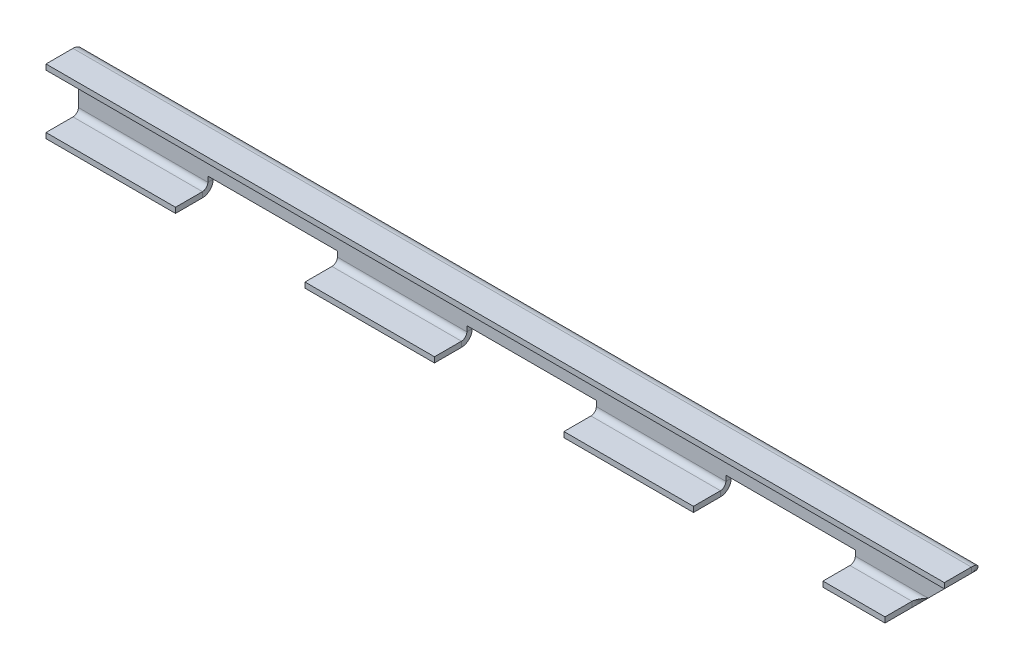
ISO-10303-21;
HEADER;
FILE_DESCRIPTION(('STEP AP214'),'2;1');
FILE_NAME('part.step','',(''),(''),'','','');
FILE_SCHEMA(('AUTOMOTIVE_DESIGN { 1 0 10303 214 1 1 1 1 }'));
ENDSEC;
DATA;
#1=APPLICATION_CONTEXT('core data for automotive mechanical design processes');
#2=APPLICATION_PROTOCOL_DEFINITION('international standard','automotive_design',2000,#1);
#3=PRODUCT_CONTEXT('',#1,'mechanical');
#4=PRODUCT('Part','Part','',(#3));
#5=PRODUCT_RELATED_PRODUCT_CATEGORY('part','',(#4));
#6=PRODUCT_DEFINITION_FORMATION('','',#4);
#7=PRODUCT_DEFINITION_CONTEXT('part definition',#1,'design');
#8=PRODUCT_DEFINITION('design','',#6,#7);
#9=PRODUCT_DEFINITION_SHAPE('','',#8);
#10=(LENGTH_UNIT() NAMED_UNIT(*) SI_UNIT(.MILLI.,.METRE.));
#11=(NAMED_UNIT(*) PLANE_ANGLE_UNIT() SI_UNIT($,.RADIAN.));
#12=(NAMED_UNIT(*) SI_UNIT($,.STERADIAN.) SOLID_ANGLE_UNIT());
#13=UNCERTAINTY_MEASURE_WITH_UNIT(LENGTH_MEASURE(1.E-05),#10,'distance_accuracy_value','');
#14=(GEOMETRIC_REPRESENTATION_CONTEXT(3) GLOBAL_UNCERTAINTY_ASSIGNED_CONTEXT((#13)) GLOBAL_UNIT_ASSIGNED_CONTEXT((#10,
#11,#12)) REPRESENTATION_CONTEXT('',''));
#15=CARTESIAN_POINT('',(0.,0.,0.));
#16=DIRECTION('',(0.,0.,1.));
#17=DIRECTION('',(1.,0.,0.));
#18=AXIS2_PLACEMENT_3D('',#15,#16,#17);
#19=CARTESIAN_POINT('',(-149.225,-76.2,38.1));
#20=DIRECTION('',(-1.,0.,0.));
#21=DIRECTION('',(0.,0.,1.));
#22=AXIS2_PLACEMENT_3D('',#19,#20,#21);
#23=PLANE('',#22);
#24=DIRECTION('',(0.,1.,0.));
#25=VECTOR('',#24,1.);
#26=CARTESIAN_POINT('',(-149.225,-76.2,-6.35));
#27=LINE('',#26,#25);
#28=CARTESIAN_POINT('',(-149.225,-63.5000000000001,-6.35));
#29=VERTEX_POINT('',#28);
#30=CARTESIAN_POINT('',(-149.225,-57.15,-6.35));
#31=VERTEX_POINT('',#30);
#32=EDGE_CURVE('E695',#29,#31,#27,.T.);
#33=ORIENTED_EDGE('',*,*,#32,.F.);
#34=DIRECTION('',(0.,0.,1.));
#35=VECTOR('',#34,1.);
#36=CARTESIAN_POINT('',(-149.225,-63.5000000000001,-6.35));
#37=LINE('',#36,#35);
#38=CARTESIAN_POINT('',(-149.225,-63.5000000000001,0.));
#39=VERTEX_POINT('',#38);
#40=EDGE_CURVE('E13',#29,#39,#37,.T.);
#41=ORIENTED_EDGE('',*,*,#40,.T.);
#42=DIRECTION('',(0.,1.,0.));
#43=VECTOR('',#42,1.);
#44=CARTESIAN_POINT('',(-149.225,0.,0.));
#45=LINE('',#44,#43);
#46=CARTESIAN_POINT('',(-149.225,-57.15,0.));
#47=VERTEX_POINT('',#46);
#48=EDGE_CURVE('E470',#39,#47,#45,.T.);
#49=ORIENTED_EDGE('',*,*,#48,.T.);
#50=DIRECTION('',(0.,0.,-1.));
#51=VECTOR('',#50,1.);
#52=CARTESIAN_POINT('',(-149.225,-57.15,38.1));
#53=LINE('',#52,#51);
#54=EDGE_CURVE('E477',#47,#31,#53,.T.);
#55=ORIENTED_EDGE('',*,*,#54,.T.);
#56=EDGE_LOOP('',(#33,#41,#49,#55));
#57=FACE_BOUND('',#56,.T.);
#58=ADVANCED_FACE('F77',(#57),#23,.T.);
#59=DIRECTION('',(0.,0.,-1.));
#60=VECTOR('',#59,1.);
#61=CARTESIAN_POINT('',(-149.225,-69.85,-2.77555756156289E-13));
#62=LINE('',#61,#60);
#63=CARTESIAN_POINT('',(-149.225,-69.8500000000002,38.1));
#64=VERTEX_POINT('',#63);
#65=CARTESIAN_POINT('',(-149.225,-69.8500000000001,6.34999999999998));
#66=VERTEX_POINT('',#65);
#67=EDGE_CURVE('E330',#64,#66,#62,.T.);
#68=ORIENTED_EDGE('',*,*,#67,.T.);
#69=DIRECTION('',(0.,-1.,0.));
#70=VECTOR('',#69,1.);
#71=CARTESIAN_POINT('',(-149.225,-69.8500000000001,6.34999999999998));
#72=LINE('',#71,#70);
#73=CARTESIAN_POINT('',(-149.225,-76.2,6.34999999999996));
#74=VERTEX_POINT('',#73);
#75=EDGE_CURVE('E85',#66,#74,#72,.T.);
#76=ORIENTED_EDGE('',*,*,#75,.T.);
#77=DIRECTION('',(0.,0.,-1.));
#78=VECTOR('',#77,1.);
#79=CARTESIAN_POINT('',(-149.225,-76.2,38.1));
#80=LINE('',#79,#78);
#81=CARTESIAN_POINT('',(-149.225,-76.2000000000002,38.1));
#82=VERTEX_POINT('',#81);
#83=EDGE_CURVE('E92',#82,#74,#80,.T.);
#84=ORIENTED_EDGE('',*,*,#83,.F.);
#85=DIRECTION('',(0.,1.,0.));
#86=VECTOR('',#85,1.);
#87=CARTESIAN_POINT('',(-149.225,-76.2,38.1));
#88=LINE('',#87,#86);
#89=EDGE_CURVE('E689',#82,#64,#88,.T.);
#90=ORIENTED_EDGE('',*,*,#89,.T.);
#91=EDGE_LOOP('',(#68,#76,#84,#90));
#92=FACE_BOUND('',#91,.T.);
#93=ADVANCED_FACE('F458',(#92),#23,.T.);
#94=CARTESIAN_POINT('',(-301.625,-76.2,38.1));
#95=DIRECTION('',(1.,0.,0.));
#96=DIRECTION('',(0.,0.,-1.));
#97=AXIS2_PLACEMENT_3D('',#94,#95,#96);
#98=PLANE('',#97);
#99=DIRECTION('',(0.,0.,-1.));
#100=VECTOR('',#99,1.);
#101=CARTESIAN_POINT('',(-301.625,-76.2,38.1));
#102=LINE('',#101,#100);
#103=CARTESIAN_POINT('',(-301.625,-76.2,38.1));
#104=VERTEX_POINT('',#103);
#105=CARTESIAN_POINT('',(-301.625,-76.2,6.34999999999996));
#106=VERTEX_POINT('',#105);
#107=EDGE_CURVE('E312',#104,#106,#102,.T.);
#108=ORIENTED_EDGE('',*,*,#107,.T.);
#109=DIRECTION('',(0.,1.,0.));
#110=VECTOR('',#109,1.);
#111=CARTESIAN_POINT('',(-301.625,-76.2,6.34999999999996));
#112=LINE('',#111,#110);
#113=CARTESIAN_POINT('',(-301.625,-69.8500000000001,6.34999999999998));
#114=VERTEX_POINT('',#113);
#115=EDGE_CURVE('E455',#106,#114,#112,.T.);
#116=ORIENTED_EDGE('',*,*,#115,.T.);
#117=DIRECTION('',(0.,0.,1.));
#118=VECTOR('',#117,1.);
#119=CARTESIAN_POINT('',(-301.625,-69.8500000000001,-2.77555756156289E-13));
#120=LINE('',#119,#118);
#121=CARTESIAN_POINT('',(-301.625,-69.8500000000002,38.1));
#122=VERTEX_POINT('',#121);
#123=EDGE_CURVE('E315',#114,#122,#120,.T.);
#124=ORIENTED_EDGE('',*,*,#123,.T.);
#125=DIRECTION('',(0.,1.,0.));
#126=VECTOR('',#125,1.);
#127=CARTESIAN_POINT('',(-301.625,-76.2000000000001,38.1));
#128=LINE('',#127,#126);
#129=EDGE_CURVE('E309',#104,#122,#128,.T.);
#130=ORIENTED_EDGE('',*,*,#129,.F.);
#131=EDGE_LOOP('',(#108,#116,#124,#130));
#132=FACE_BOUND('',#131,.T.);
#133=ADVANCED_FACE('F311',(#132),#98,.T.);
#134=DIRECTION('',(0.,-1.,0.));
#135=VECTOR('',#134,1.);
#136=CARTESIAN_POINT('',(-301.625,0.,0.));
#137=LINE('',#136,#135);
#138=CARTESIAN_POINT('',(-301.625,-57.15,0.));
#139=VERTEX_POINT('',#138);
#140=CARTESIAN_POINT('',(-301.625,-63.5000000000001,0.));
#141=VERTEX_POINT('',#140);
#142=EDGE_CURVE('E618',#139,#141,#137,.T.);
#143=ORIENTED_EDGE('',*,*,#142,.T.);
#144=DIRECTION('',(0.,0.,-1.));
#145=VECTOR('',#144,1.);
#146=CARTESIAN_POINT('',(-301.625,-63.5000000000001,0.));
#147=LINE('',#146,#145);
#148=CARTESIAN_POINT('',(-301.625,-63.5000000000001,-6.35));
#149=VERTEX_POINT('',#148);
#150=EDGE_CURVE('E453',#141,#149,#147,.T.);
#151=ORIENTED_EDGE('',*,*,#150,.T.);
#152=DIRECTION('',(0.,-1.,0.));
#153=VECTOR('',#152,1.);
#154=CARTESIAN_POINT('',(-301.625,-76.2,-6.35));
#155=LINE('',#154,#153);
#156=CARTESIAN_POINT('',(-301.625,-57.15,-6.35));
#157=VERTEX_POINT('',#156);
#158=EDGE_CURVE('E698',#157,#149,#155,.T.);
#159=ORIENTED_EDGE('',*,*,#158,.F.);
#160=DIRECTION('',(0.,0.,-1.));
#161=VECTOR('',#160,1.);
#162=CARTESIAN_POINT('',(-301.625,-57.15,38.1));
#163=LINE('',#162,#161);
#164=EDGE_CURVE('E690',#139,#157,#163,.T.);
#165=ORIENTED_EDGE('',*,*,#164,.F.);
#166=EDGE_LOOP('',(#143,#151,#159,#165));
#167=FACE_BOUND('',#166,.T.);
#168=ADVANCED_FACE('F807',(#167),#98,.T.);
#169=CARTESIAN_POINT('',(-454.025,-76.2,38.1));
#170=DIRECTION('',(-1.,0.,0.));
#171=DIRECTION('',(0.,0.,1.));
#172=AXIS2_PLACEMENT_3D('',#169,#170,#171);
#173=PLANE('',#172);
#174=DIRECTION('',(0.,1.,0.));
#175=VECTOR('',#174,1.);
#176=CARTESIAN_POINT('',(-454.025,-76.2,-6.35));
#177=LINE('',#176,#175);
#178=CARTESIAN_POINT('',(-454.025,-63.5000000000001,-6.35));
#179=VERTEX_POINT('',#178);
#180=CARTESIAN_POINT('',(-454.025,-57.15,-6.35));
#181=VERTEX_POINT('',#180);
#182=EDGE_CURVE('E628',#179,#181,#177,.T.);
#183=ORIENTED_EDGE('',*,*,#182,.F.);
#184=DIRECTION('',(0.,0.,1.));
#185=VECTOR('',#184,1.);
#186=CARTESIAN_POINT('',(-454.025,-63.5000000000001,-6.35));
#187=LINE('',#186,#185);
#188=CARTESIAN_POINT('',(-454.025,-63.5000000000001,0.));
#189=VERTEX_POINT('',#188);
#190=EDGE_CURVE('E451',#179,#189,#187,.T.);
#191=ORIENTED_EDGE('',*,*,#190,.T.);
#192=DIRECTION('',(0.,1.,0.));
#193=VECTOR('',#192,1.);
#194=CARTESIAN_POINT('',(-454.025,0.,0.));
#195=LINE('',#194,#193);
#196=CARTESIAN_POINT('',(-454.025,-57.15,0.));
#197=VERTEX_POINT('',#196);
#198=EDGE_CURVE('E644',#189,#197,#195,.T.);
#199=ORIENTED_EDGE('',*,*,#198,.T.);
#200=DIRECTION('',(0.,0.,-1.));
#201=VECTOR('',#200,1.);
#202=CARTESIAN_POINT('',(-454.025,-57.15,38.1));
#203=LINE('',#202,#201);
#204=EDGE_CURVE('E634',#197,#181,#203,.T.);
#205=ORIENTED_EDGE('',*,*,#204,.T.);
#206=EDGE_LOOP('',(#183,#191,#199,#205));
#207=FACE_BOUND('',#206,.T.);
#208=ADVANCED_FACE('F794',(#207),#173,.T.);
#209=DIRECTION('',(0.,0.,-1.));
#210=VECTOR('',#209,1.);
#211=CARTESIAN_POINT('',(-454.025,-69.8500000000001,-2.77555756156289E-13));
#212=LINE('',#211,#210);
#213=CARTESIAN_POINT('',(-454.025,-69.8500000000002,38.1));
#214=VERTEX_POINT('',#213);
#215=CARTESIAN_POINT('',(-454.025,-69.8500000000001,6.34999999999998));
#216=VERTEX_POINT('',#215);
#217=EDGE_CURVE('E638',#214,#216,#212,.T.);
#218=ORIENTED_EDGE('',*,*,#217,.T.);
#219=DIRECTION('',(0.,-1.,0.));
#220=VECTOR('',#219,1.);
#221=CARTESIAN_POINT('',(-454.025,-69.8500000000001,6.34999999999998));
#222=LINE('',#221,#220);
#223=CARTESIAN_POINT('',(-454.025,-76.2,6.34999999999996));
#224=VERTEX_POINT('',#223);
#225=EDGE_CURVE('E449',#216,#224,#222,.T.);
#226=ORIENTED_EDGE('',*,*,#225,.T.);
#227=DIRECTION('',(0.,0.,-1.));
#228=VECTOR('',#227,1.);
#229=CARTESIAN_POINT('',(-454.025,-76.2,38.1));
#230=LINE('',#229,#228);
#231=CARTESIAN_POINT('',(-454.025,-76.2000000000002,38.1));
#232=VERTEX_POINT('',#231);
#233=EDGE_CURVE('E100',#232,#224,#230,.T.);
#234=ORIENTED_EDGE('',*,*,#233,.F.);
#235=DIRECTION('',(0.,1.,0.));
#236=VECTOR('',#235,1.);
#237=CARTESIAN_POINT('',(-454.025,-76.2,38.1));
#238=LINE('',#237,#236);
#239=EDGE_CURVE('E333',#232,#214,#238,.T.);
#240=ORIENTED_EDGE('',*,*,#239,.T.);
#241=EDGE_LOOP('',(#218,#226,#234,#240));
#242=FACE_BOUND('',#241,.T.);
#243=ADVANCED_FACE('F814',(#242),#173,.T.);
#244=CARTESIAN_POINT('',(-606.425,-76.2,38.1));
#245=DIRECTION('',(1.,0.,0.));
#246=DIRECTION('',(0.,0.,-1.));
#247=AXIS2_PLACEMENT_3D('',#244,#245,#246);
#248=PLANE('',#247);
#249=DIRECTION('',(0.,0.,-1.));
#250=VECTOR('',#249,1.);
#251=CARTESIAN_POINT('',(-606.425,-76.2,38.1));
#252=LINE('',#251,#250);
#253=CARTESIAN_POINT('',(-606.425,-76.2,38.1));
#254=VERTEX_POINT('',#253);
#255=CARTESIAN_POINT('',(-606.425,-76.2,6.34999999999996));
#256=VERTEX_POINT('',#255);
#257=EDGE_CURVE('E491',#254,#256,#252,.T.);
#258=ORIENTED_EDGE('',*,*,#257,.T.);
#259=DIRECTION('',(0.,1.,0.));
#260=VECTOR('',#259,1.);
#261=CARTESIAN_POINT('',(-606.425,-76.2,6.34999999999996));
#262=LINE('',#261,#260);
#263=CARTESIAN_POINT('',(-606.425,-69.8500000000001,6.34999999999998));
#264=VERTEX_POINT('',#263);
#265=EDGE_CURVE('E447',#256,#264,#262,.T.);
#266=ORIENTED_EDGE('',*,*,#265,.T.);
#267=DIRECTION('',(0.,0.,1.));
#268=VECTOR('',#267,1.);
#269=CARTESIAN_POINT('',(-606.425,-69.8500000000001,-2.77555756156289E-13));
#270=LINE('',#269,#268);
#271=CARTESIAN_POINT('',(-606.425,-69.8500000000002,38.1));
#272=VERTEX_POINT('',#271);
#273=EDGE_CURVE('E649',#264,#272,#270,.T.);
#274=ORIENTED_EDGE('',*,*,#273,.T.);
#275=DIRECTION('',(0.,1.,0.));
#276=VECTOR('',#275,1.);
#277=CARTESIAN_POINT('',(-606.425,-76.2000000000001,38.1));
#278=LINE('',#277,#276);
#279=EDGE_CURVE('E432',#254,#272,#278,.T.);
#280=ORIENTED_EDGE('',*,*,#279,.F.);
#281=EDGE_LOOP('',(#258,#266,#274,#280));
#282=FACE_BOUND('',#281,.T.);
#283=ADVANCED_FACE('F848',(#282),#248,.T.);
#284=DIRECTION('',(0.,-1.,0.));
#285=VECTOR('',#284,1.);
#286=CARTESIAN_POINT('',(-606.425,0.,0.));
#287=LINE('',#286,#285);
#288=CARTESIAN_POINT('',(-606.425,-57.15,0.));
#289=VERTEX_POINT('',#288);
#290=CARTESIAN_POINT('',(-606.425,-63.5000000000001,0.));
#291=VERTEX_POINT('',#290);
#292=EDGE_CURVE('E507',#289,#291,#287,.T.);
#293=ORIENTED_EDGE('',*,*,#292,.T.);
#294=DIRECTION('',(0.,0.,-1.));
#295=VECTOR('',#294,1.);
#296=CARTESIAN_POINT('',(-606.425,-63.5000000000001,0.));
#297=LINE('',#296,#295);
#298=CARTESIAN_POINT('',(-606.425,-63.5000000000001,-6.35));
#299=VERTEX_POINT('',#298);
#300=EDGE_CURVE('E445',#291,#299,#297,.T.);
#301=ORIENTED_EDGE('',*,*,#300,.T.);
#302=DIRECTION('',(0.,-1.,0.));
#303=VECTOR('',#302,1.);
#304=CARTESIAN_POINT('',(-606.425,-76.2,-6.35));
#305=LINE('',#304,#303);
#306=CARTESIAN_POINT('',(-606.425,-57.15,-6.35));
#307=VERTEX_POINT('',#306);
#308=EDGE_CURVE('E623',#307,#299,#305,.T.);
#309=ORIENTED_EDGE('',*,*,#308,.F.);
#310=DIRECTION('',(0.,0.,-1.));
#311=VECTOR('',#310,1.);
#312=CARTESIAN_POINT('',(-606.425,-57.15,38.1));
#313=LINE('',#312,#311);
#314=EDGE_CURVE('E625',#289,#307,#313,.T.);
#315=ORIENTED_EDGE('',*,*,#314,.F.);
#316=EDGE_LOOP('',(#293,#301,#309,#315));
#317=FACE_BOUND('',#316,.T.);
#318=ADVANCED_FACE('F849',(#317),#248,.T.);
#319=CARTESIAN_POINT('',(-758.825,-76.2,38.1));
#320=DIRECTION('',(-1.,0.,0.));
#321=DIRECTION('',(0.,0.,1.));
#322=AXIS2_PLACEMENT_3D('',#319,#320,#321);
#323=PLANE('',#322);
#324=DIRECTION('',(0.,1.,0.));
#325=VECTOR('',#324,1.);
#326=CARTESIAN_POINT('',(-758.825,-76.2,-6.35));
#327=LINE('',#326,#325);
#328=CARTESIAN_POINT('',(-758.825,-63.5000000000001,-6.35));
#329=VERTEX_POINT('',#328);
#330=CARTESIAN_POINT('',(-758.825,-57.15,-6.35));
#331=VERTEX_POINT('',#330);
#332=EDGE_CURVE('E510',#329,#331,#327,.T.);
#333=ORIENTED_EDGE('',*,*,#332,.F.);
#334=DIRECTION('',(0.,0.,1.));
#335=VECTOR('',#334,1.);
#336=CARTESIAN_POINT('',(-758.825,-63.5000000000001,-6.35));
#337=LINE('',#336,#335);
#338=CARTESIAN_POINT('',(-758.825,-63.5000000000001,0.));
#339=VERTEX_POINT('',#338);
#340=EDGE_CURVE('E443',#329,#339,#337,.T.);
#341=ORIENTED_EDGE('',*,*,#340,.T.);
#342=DIRECTION('',(0.,1.,0.));
#343=VECTOR('',#342,1.);
#344=CARTESIAN_POINT('',(-758.825,0.,0.));
#345=LINE('',#344,#343);
#346=CARTESIAN_POINT('',(-758.825,-57.15,0.));
#347=VERTEX_POINT('',#346);
#348=EDGE_CURVE('E538',#339,#347,#345,.T.);
#349=ORIENTED_EDGE('',*,*,#348,.T.);
#350=DIRECTION('',(0.,0.,-1.));
#351=VECTOR('',#350,1.);
#352=CARTESIAN_POINT('',(-758.825,-57.15,38.1));
#353=LINE('',#352,#351);
#354=EDGE_CURVE('E526',#347,#331,#353,.T.);
#355=ORIENTED_EDGE('',*,*,#354,.T.);
#356=EDGE_LOOP('',(#333,#341,#349,#355));
#357=FACE_BOUND('',#356,.T.);
#358=ADVANCED_FACE('F863',(#357),#323,.T.);
#359=DIRECTION('',(0.,0.,-1.));
#360=VECTOR('',#359,1.);
#361=CARTESIAN_POINT('',(-758.825,-69.8500000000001,-2.77555756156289E-13));
#362=LINE('',#361,#360);
#363=CARTESIAN_POINT('',(-758.825,-69.8500000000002,38.1));
#364=VERTEX_POINT('',#363);
#365=CARTESIAN_POINT('',(-758.825,-69.8500000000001,6.34999999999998));
#366=VERTEX_POINT('',#365);
#367=EDGE_CURVE('E532',#364,#366,#362,.T.);
#368=ORIENTED_EDGE('',*,*,#367,.T.);
#369=DIRECTION('',(0.,-1.,0.));
#370=VECTOR('',#369,1.);
#371=CARTESIAN_POINT('',(-758.825,-69.8500000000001,6.34999999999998));
#372=LINE('',#371,#370);
#373=CARTESIAN_POINT('',(-758.825,-76.2,6.34999999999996));
#374=VERTEX_POINT('',#373);
#375=EDGE_CURVE('E441',#366,#374,#372,.T.);
#376=ORIENTED_EDGE('',*,*,#375,.T.);
#377=DIRECTION('',(0.,0.,-1.));
#378=VECTOR('',#377,1.);
#379=CARTESIAN_POINT('',(-758.825,-76.2,38.1));
#380=LINE('',#379,#378);
#381=CARTESIAN_POINT('',(-758.825,-76.2000000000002,38.1));
#382=VERTEX_POINT('',#381);
#383=EDGE_CURVE('E492',#382,#374,#380,.T.);
#384=ORIENTED_EDGE('',*,*,#383,.F.);
#385=DIRECTION('',(0.,1.,0.));
#386=VECTOR('',#385,1.);
#387=CARTESIAN_POINT('',(-758.825,-76.2,38.1));
#388=LINE('',#387,#386);
#389=EDGE_CURVE('E517',#382,#364,#388,.T.);
#390=ORIENTED_EDGE('',*,*,#389,.T.);
#391=EDGE_LOOP('',(#368,#376,#384,#390));
#392=FACE_BOUND('',#391,.T.);
#393=ADVANCED_FACE('F864',(#392),#323,.T.);
#394=CARTESIAN_POINT('',(-911.225,-76.2,38.1));
#395=DIRECTION('',(1.,0.,0.));
#396=DIRECTION('',(0.,0.,-1.));
#397=AXIS2_PLACEMENT_3D('',#394,#395,#396);
#398=PLANE('',#397);
#399=DIRECTION('',(0.,0.,-1.));
#400=VECTOR('',#399,1.);
#401=CARTESIAN_POINT('',(-911.225,-76.2,38.1));
#402=LINE('',#401,#400);
#403=CARTESIAN_POINT('',(-911.225,-76.2,38.1));
#404=VERTEX_POINT('',#403);
#405=CARTESIAN_POINT('',(-911.225,-76.2,6.34999999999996));
#406=VERTEX_POINT('',#405);
#407=EDGE_CURVE('E529',#404,#406,#402,.T.);
#408=ORIENTED_EDGE('',*,*,#407,.T.);
#409=DIRECTION('',(0.,1.,0.));
#410=VECTOR('',#409,1.);
#411=CARTESIAN_POINT('',(-911.225,-76.2,6.34999999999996));
#412=LINE('',#411,#410);
#413=CARTESIAN_POINT('',(-911.225,-69.8500000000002,6.34999999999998));
#414=VERTEX_POINT('',#413);
#415=EDGE_CURVE('E439',#406,#414,#412,.T.);
#416=ORIENTED_EDGE('',*,*,#415,.T.);
#417=DIRECTION('',(0.,0.,1.));
#418=VECTOR('',#417,1.);
#419=CARTESIAN_POINT('',(-911.225,-69.8500000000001,-2.7755575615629E-13));
#420=LINE('',#419,#418);
#421=CARTESIAN_POINT('',(-911.225,-69.8500000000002,38.1));
#422=VERTEX_POINT('',#421);
#423=EDGE_CURVE('E541',#414,#422,#420,.T.);
#424=ORIENTED_EDGE('',*,*,#423,.T.);
#425=DIRECTION('',(0.,1.,0.));
#426=VECTOR('',#425,1.);
#427=CARTESIAN_POINT('',(-911.225,-76.2000000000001,38.1));
#428=LINE('',#427,#426);
#429=EDGE_CURVE('E425',#404,#422,#428,.T.);
#430=ORIENTED_EDGE('',*,*,#429,.F.);
#431=EDGE_LOOP('',(#408,#416,#424,#430));
#432=FACE_BOUND('',#431,.T.);
#433=ADVANCED_FACE('F767',(#432),#398,.T.);
#434=DIRECTION('',(0.,-1.,0.));
#435=VECTOR('',#434,1.);
#436=CARTESIAN_POINT('',(-911.225,0.,0.));
#437=LINE('',#436,#435);
#438=CARTESIAN_POINT('',(-911.225,-57.15,0.));
#439=VERTEX_POINT('',#438);
#440=CARTESIAN_POINT('',(-911.225,-63.5000000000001,0.));
#441=VERTEX_POINT('',#440);
#442=EDGE_CURVE('E546',#439,#441,#437,.T.);
#443=ORIENTED_EDGE('',*,*,#442,.T.);
#444=DIRECTION('',(0.,0.,-1.));
#445=VECTOR('',#444,1.);
#446=CARTESIAN_POINT('',(-911.225,-63.5000000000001,0.));
#447=LINE('',#446,#445);
#448=CARTESIAN_POINT('',(-911.225,-63.5000000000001,-6.35));
#449=VERTEX_POINT('',#448);
#450=EDGE_CURVE('E437',#441,#449,#447,.T.);
#451=ORIENTED_EDGE('',*,*,#450,.T.);
#452=DIRECTION('',(0.,-1.,0.));
#453=VECTOR('',#452,1.);
#454=CARTESIAN_POINT('',(-911.225,-76.2,-6.35));
#455=LINE('',#454,#453);
#456=CARTESIAN_POINT('',(-911.225,-57.15,-6.35));
#457=VERTEX_POINT('',#456);
#458=EDGE_CURVE('E506',#457,#449,#455,.T.);
#459=ORIENTED_EDGE('',*,*,#458,.F.);
#460=DIRECTION('',(0.,0.,-1.));
#461=VECTOR('',#460,1.);
#462=CARTESIAN_POINT('',(-911.225,-57.15,38.1));
#463=LINE('',#462,#461);
#464=EDGE_CURVE('E518',#439,#457,#463,.T.);
#465=ORIENTED_EDGE('',*,*,#464,.F.);
#466=EDGE_LOOP('',(#443,#451,#459,#465));
#467=FACE_BOUND('',#466,.T.);
#468=ADVANCED_FACE('F780',(#467),#398,.T.);
#469=CARTESIAN_POINT('',(0.,0.,-6.35));
#470=DIRECTION('',(0.,0.,-1.));
#471=DIRECTION('',(-1.,0.,0.));
#472=AXIS2_PLACEMENT_3D('',#469,#470,#471);
#473=PLANE('',#472);
#474=DIRECTION('',(-1.,0.,0.));
#475=VECTOR('',#474,1.);
#476=CARTESIAN_POINT('',(-301.625,-57.15,-6.35));
#477=LINE('',#476,#475);
#478=EDGE_CURVE('E691',#31,#157,#477,.T.);
#479=ORIENTED_EDGE('',*,*,#478,.T.);
#480=ORIENTED_EDGE('',*,*,#158,.T.);
#481=DIRECTION('',(1.,0.,0.));
#482=VECTOR('',#481,1.);
#483=CARTESIAN_POINT('',(0.,-63.5,-6.35000000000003));
#484=LINE('',#483,#482);
#485=EDGE_CURVE('E371',#149,#179,#484,.F.);
#486=ORIENTED_EDGE('',*,*,#485,.T.);
#487=ORIENTED_EDGE('',*,*,#182,.T.);
#488=DIRECTION('',(-1.,0.,0.));
#489=VECTOR('',#488,1.);
#490=CARTESIAN_POINT('',(-606.425,-57.15,-6.35));
#491=LINE('',#490,#489);
#492=EDGE_CURVE('E626',#181,#307,#491,.T.);
#493=ORIENTED_EDGE('',*,*,#492,.T.);
#494=ORIENTED_EDGE('',*,*,#308,.T.);
#495=EDGE_CURVE('E503',#299,#329,#484,.F.);
#496=ORIENTED_EDGE('',*,*,#495,.T.);
#497=ORIENTED_EDGE('',*,*,#332,.T.);
#498=DIRECTION('',(-1.,0.,0.));
#499=VECTOR('',#498,1.);
#500=CARTESIAN_POINT('',(-911.225,-57.15,-6.35));
#501=LINE('',#500,#499);
#502=EDGE_CURVE('E519',#331,#457,#501,.T.);
#503=ORIENTED_EDGE('',*,*,#502,.T.);
#504=ORIENTED_EDGE('',*,*,#458,.T.);
#505=CARTESIAN_POINT('',(-1063.625,-63.5,-6.35));
#506=VERTEX_POINT('',#505);
#507=EDGE_CURVE('E372',#449,#506,#484,.F.);
#508=ORIENTED_EDGE('',*,*,#507,.T.);
#509=DIRECTION('',(0.,-1.,0.));
#510=VECTOR('',#509,1.);
#511=CARTESIAN_POINT('',(-1063.625,-76.2000000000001,-6.35));
#512=LINE('',#511,#510);
#513=CARTESIAN_POINT('',(-1063.625,-12.7000000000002,-6.35000000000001));
#514=VERTEX_POINT('',#513);
#515=EDGE_CURVE('E422',#514,#506,#512,.T.);
#516=ORIENTED_EDGE('',*,*,#515,.F.);
#517=DIRECTION('',(-1.,0.,0.));
#518=VECTOR('',#517,1.);
#519=CARTESIAN_POINT('',(-1063.625,-12.7000000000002,-6.35000000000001));
#520=LINE('',#519,#518);
#521=CARTESIAN_POINT('',(-12.7000000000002,-12.7,-6.35000000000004));
#522=VERTEX_POINT('',#521);
#523=EDGE_CURVE('E407',#514,#522,#520,.F.);
#524=ORIENTED_EDGE('',*,*,#523,.T.);
#525=DIRECTION('',(0.707106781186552,0.707106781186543,0.));
#526=VECTOR('',#525,1.);
#527=CARTESIAN_POINT('',(0.,0.,-6.35));
#528=LINE('',#527,#526);
#529=CARTESIAN_POINT('',(-63.5000000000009,-63.5000000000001,-6.35000000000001));
#530=VERTEX_POINT('',#529);
#531=EDGE_CURVE('E581',#530,#522,#528,.T.);
#532=ORIENTED_EDGE('',*,*,#531,.F.);
#533=EDGE_CURVE('E367',#530,#29,#484,.F.);
#534=ORIENTED_EDGE('',*,*,#533,.T.);
#535=ORIENTED_EDGE('',*,*,#32,.T.);
#536=EDGE_LOOP('',(#479,#480,#486,#487,#493,#494,#496,#497,#503,#504,#508,#516,#524,#532,#534,#535));
#537=FACE_BOUND('',#536,.T.);
#538=ADVANCED_FACE('F709',(#537),#473,.T.);
#539=CARTESIAN_POINT('',(0.,0.,0.));
#540=DIRECTION('',(0.,0.,-1.));
#541=DIRECTION('',(-1.,0.,0.));
#542=AXIS2_PLACEMENT_3D('',#539,#540,#541);
#543=PLANE('',#542);
#544=ORIENTED_EDGE('',*,*,#142,.F.);
#545=DIRECTION('',(-1.,0.,0.));
#546=VECTOR('',#545,1.);
#547=CARTESIAN_POINT('',(0.,-57.15,0.));
#548=LINE('',#547,#546);
#549=EDGE_CURVE('E320',#47,#139,#548,.T.);
#550=ORIENTED_EDGE('',*,*,#549,.F.);
#551=ORIENTED_EDGE('',*,*,#48,.F.);
#552=DIRECTION('',(1.,0.,0.));
#553=VECTOR('',#552,1.);
#554=CARTESIAN_POINT('',(0.,-63.5000000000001,0.));
#555=LINE('',#554,#553);
#556=CARTESIAN_POINT('',(-63.5000000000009,-63.5000000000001,0.));
#557=VERTEX_POINT('',#556);
#558=EDGE_CURVE('E379',#557,#39,#555,.F.);
#559=ORIENTED_EDGE('',*,*,#558,.F.);
#560=DIRECTION('',(0.707106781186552,0.707106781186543,0.));
#561=VECTOR('',#560,1.);
#562=CARTESIAN_POINT('',(0.,0.,0.));
#563=LINE('',#562,#561);
#564=CARTESIAN_POINT('',(-12.7000000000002,-12.7,0.));
#565=VERTEX_POINT('',#564);
#566=EDGE_CURVE('E584',#557,#565,#563,.T.);
#567=ORIENTED_EDGE('',*,*,#566,.T.);
#568=DIRECTION('',(-1.,0.,0.));
#569=VECTOR('',#568,1.);
#570=CARTESIAN_POINT('',(-1063.625,-12.7000000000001,0.));
#571=LINE('',#570,#569);
#572=CARTESIAN_POINT('',(-1063.625,-12.7000000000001,0.));
#573=VERTEX_POINT('',#572);
#574=EDGE_CURVE('E414',#573,#565,#571,.F.);
#575=ORIENTED_EDGE('',*,*,#574,.F.);
#576=DIRECTION('',(0.,-1.,0.));
#577=VECTOR('',#576,1.);
#578=CARTESIAN_POINT('',(-1063.625,-76.2000000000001,0.));
#579=LINE('',#578,#577);
#580=CARTESIAN_POINT('',(-1063.625,-63.5000000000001,0.));
#581=VERTEX_POINT('',#580);
#582=EDGE_CURVE('E421',#573,#581,#579,.T.);
#583=ORIENTED_EDGE('',*,*,#582,.T.);
#584=EDGE_CURVE('E383',#441,#581,#555,.F.);
#585=ORIENTED_EDGE('',*,*,#584,.F.);
#586=ORIENTED_EDGE('',*,*,#442,.F.);
#587=DIRECTION('',(-1.,0.,0.));
#588=VECTOR('',#587,1.);
#589=CARTESIAN_POINT('',(0.,-57.15,0.));
#590=LINE('',#589,#588);
#591=EDGE_CURVE('E430',#347,#439,#590,.T.);
#592=ORIENTED_EDGE('',*,*,#591,.F.);
#593=ORIENTED_EDGE('',*,*,#348,.F.);
#594=EDGE_CURVE('E783',#291,#339,#555,.F.);
#595=ORIENTED_EDGE('',*,*,#594,.F.);
#596=ORIENTED_EDGE('',*,*,#292,.F.);
#597=DIRECTION('',(-1.,0.,0.));
#598=VECTOR('',#597,1.);
#599=CARTESIAN_POINT('',(0.,-57.15,0.));
#600=LINE('',#599,#598);
#601=EDGE_CURVE('E321',#197,#289,#600,.T.);
#602=ORIENTED_EDGE('',*,*,#601,.F.);
#603=ORIENTED_EDGE('',*,*,#198,.F.);
#604=EDGE_CURVE('E382',#141,#189,#555,.F.);
#605=ORIENTED_EDGE('',*,*,#604,.F.);
#606=EDGE_LOOP('',(#544,#550,#551,#559,#567,#575,#583,#585,#586,#592,#593,#595,#596,#602,#603,#605));
#607=FACE_BOUND('',#606,.T.);
#608=ADVANCED_FACE('F604',(#607),#543,.F.);
#609=CARTESIAN_POINT('',(0.,-63.5000000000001,6.35000000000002));
#610=DIRECTION('',(1.,0.,0.));
#611=DIRECTION('',(0.,-1.,0.));
#612=AXIS2_PLACEMENT_3D('',#609,#610,#611);
#613=CYLINDRICAL_SURFACE('',#612,12.7);
#614=ORIENTED_EDGE('',*,*,#485,.F.);
#615=CARTESIAN_POINT('',(-301.625,-63.5000000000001,6.35000000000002));
#616=DIRECTION('',(1.,0.,0.));
#617=DIRECTION('',(0.,0.,-1.));
#618=AXIS2_PLACEMENT_3D('',#615,#616,#617);
#619=CIRCLE('',#618,12.7);
#620=EDGE_CURVE('E621',#149,#106,#619,.F.);
#621=ORIENTED_EDGE('',*,*,#620,.T.);
#622=DIRECTION('',(1.,0.,0.));
#623=VECTOR('',#622,1.);
#624=CARTESIAN_POINT('',(0.,-76.2,6.34999999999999));
#625=LINE('',#624,#623);
#626=EDGE_CURVE('E329',#224,#106,#625,.T.);
#627=ORIENTED_EDGE('',*,*,#626,.F.);
#628=CARTESIAN_POINT('',(-454.025,-63.5000000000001,6.35000000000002));
#629=DIRECTION('',(-1.,0.,0.));
#630=DIRECTION('',(0.,0.,1.));
#631=AXIS2_PLACEMENT_3D('',#628,#629,#630);
#632=CIRCLE('',#631,12.7);
#633=EDGE_CURVE('E646',#224,#179,#632,.F.);
#634=ORIENTED_EDGE('',*,*,#633,.T.);
#635=EDGE_LOOP('',(#614,#621,#627,#634));
#636=FACE_BOUND('',#635,.T.);
#637=ADVANCED_FACE('F802',(#636),#613,.T.);
#638=CARTESIAN_POINT('',(-76.2000000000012,-76.2000000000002,6.34999999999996));
#639=VERTEX_POINT('',#638);
#640=EDGE_CURVE('E357',#74,#639,#625,.T.);
#641=ORIENTED_EDGE('',*,*,#640,.F.);
#642=CARTESIAN_POINT('',(-149.225,-63.5000000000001,6.35000000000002));
#643=DIRECTION('',(-1.,0.,0.));
#644=DIRECTION('',(0.,0.,1.));
#645=AXIS2_PLACEMENT_3D('',#642,#643,#644);
#646=CIRCLE('',#645,12.7);
#647=EDGE_CURVE('E464',#74,#29,#646,.F.);
#648=ORIENTED_EDGE('',*,*,#647,.T.);
#649=ORIENTED_EDGE('',*,*,#533,.F.);
#650=CARTESIAN_POINT('',(-63.5000000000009,-63.5000000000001,6.35000000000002));
#651=DIRECTION('',(-0.707106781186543,0.707106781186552,0.));
#652=DIRECTION('',(0.707106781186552,0.707106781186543,0.));
#653=AXIS2_PLACEMENT_3D('',#650,#651,#652);
#654=ELLIPSE('',#653,17.9605122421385,12.7);
#655=EDGE_CURVE('E482',#639,#530,#654,.F.);
#656=ORIENTED_EDGE('',*,*,#655,.F.);
#657=EDGE_LOOP('',(#641,#648,#649,#656));
#658=FACE_BOUND('',#657,.T.);
#659=ADVANCED_FACE('F480',(#658),#613,.T.);
#660=CARTESIAN_POINT('',(0.,-63.5000000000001,6.35000000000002));
#661=DIRECTION('',(1.,0.,0.));
#662=DIRECTION('',(0.,-1.,0.));
#663=AXIS2_PLACEMENT_3D('',#660,#661,#662);
#664=CYLINDRICAL_SURFACE('',#663,6.35000000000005);
#665=CARTESIAN_POINT('',(-301.625,-63.5000000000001,6.35000000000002));
#666=DIRECTION('',(1.,0.,0.));
#667=DIRECTION('',(0.,0.,-1.));
#668=AXIS2_PLACEMENT_3D('',#665,#666,#667);
#669=CIRCLE('',#668,6.35000000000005);
#670=EDGE_CURVE('E615',#141,#114,#669,.F.);
#671=ORIENTED_EDGE('',*,*,#670,.F.);
#672=ORIENTED_EDGE('',*,*,#604,.T.);
#673=CARTESIAN_POINT('',(-454.025,-63.5000000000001,6.35000000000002));
#674=DIRECTION('',(-1.,0.,0.));
#675=DIRECTION('',(0.,0.,1.));
#676=AXIS2_PLACEMENT_3D('',#673,#674,#675);
#677=CIRCLE('',#676,6.35000000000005);
#678=EDGE_CURVE('E641',#216,#189,#677,.F.);
#679=ORIENTED_EDGE('',*,*,#678,.F.);
#680=DIRECTION('',(-1.,0.,0.));
#681=VECTOR('',#680,1.);
#682=CARTESIAN_POINT('',(-1063.625,-69.8500000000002,6.34999999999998));
#683=LINE('',#682,#681);
#684=EDGE_CURVE('E667',#216,#114,#683,.F.);
#685=ORIENTED_EDGE('',*,*,#684,.T.);
#686=EDGE_LOOP('',(#671,#672,#679,#685));
#687=FACE_BOUND('',#686,.T.);
#688=ADVANCED_FACE('F673',(#687),#664,.F.);
#689=CARTESIAN_POINT('',(-149.225,-63.5000000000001,6.35000000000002));
#690=DIRECTION('',(-1.,0.,0.));
#691=DIRECTION('',(0.,0.,1.));
#692=AXIS2_PLACEMENT_3D('',#689,#690,#691);
#693=CIRCLE('',#692,6.35000000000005);
#694=EDGE_CURVE('E609',#66,#39,#693,.F.);
#695=ORIENTED_EDGE('',*,*,#694,.F.);
#696=CARTESIAN_POINT('',(-76.2000000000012,-69.8500000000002,6.34999999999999));
#697=VERTEX_POINT('',#696);
#698=EDGE_CURVE('E362',#66,#697,#683,.F.);
#699=ORIENTED_EDGE('',*,*,#698,.T.);
#700=CARTESIAN_POINT('',(-63.5000000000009,-63.5000000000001,6.35000000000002));
#701=DIRECTION('',(-0.447213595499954,0.894427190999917,0.));
#702=DIRECTION('',(0.894427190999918,0.447213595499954,0.));
#703=AXIS2_PLACEMENT_3D('',#700,#701,#702);
#704=ELLIPSE('',#703,14.1990316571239,6.35000000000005);
#705=EDGE_CURVE('E568',#697,#557,#704,.F.);
#706=ORIENTED_EDGE('',*,*,#705,.T.);
#707=ORIENTED_EDGE('',*,*,#558,.T.);
#708=EDGE_LOOP('',(#695,#699,#706,#707));
#709=FACE_BOUND('',#708,.T.);
#710=ADVANCED_FACE('F599',(#709),#664,.F.);
#711=CARTESIAN_POINT('',(0.,-76.2,-2.99726662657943E-13));
#712=DIRECTION('',(0.,-1.,0.));
#713=DIRECTION('',(0.,0.,-1.));
#714=AXIS2_PLACEMENT_3D('',#711,#712,#713);
#715=PLANE('',#714);
#716=ORIENTED_EDGE('',*,*,#626,.T.);
#717=ORIENTED_EDGE('',*,*,#107,.F.);
#718=DIRECTION('',(1.,0.,0.));
#719=VECTOR('',#718,1.);
#720=CARTESIAN_POINT('',(0.,-76.2000000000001,38.1));
#721=LINE('',#720,#719);
#722=EDGE_CURVE('E327',#232,#104,#721,.T.);
#723=ORIENTED_EDGE('',*,*,#722,.F.);
#724=ORIENTED_EDGE('',*,*,#233,.T.);
#725=EDGE_LOOP('',(#716,#717,#723,#724));
#726=FACE_BOUND('',#725,.T.);
#727=ADVANCED_FACE('F326',(#726),#715,.T.);
#728=CARTESIAN_POINT('',(-76.2000000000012,-76.2000000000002,38.1));
#729=VERTEX_POINT('',#728);
#730=EDGE_CURVE('E335',#82,#729,#721,.T.);
#731=ORIENTED_EDGE('',*,*,#730,.F.);
#732=ORIENTED_EDGE('',*,*,#83,.T.);
#733=ORIENTED_EDGE('',*,*,#640,.T.);
#734=DIRECTION('',(0.,0.,-1.));
#735=VECTOR('',#734,1.);
#736=CARTESIAN_POINT('',(-76.2000000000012,-76.2000000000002,38.1));
#737=LINE('',#736,#735);
#738=EDGE_CURVE('E571',#729,#639,#737,.T.);
#739=ORIENTED_EDGE('',*,*,#738,.F.);
#740=EDGE_LOOP('',(#731,#732,#733,#739));
#741=FACE_BOUND('',#740,.T.);
#742=ADVANCED_FACE('F474',(#741),#715,.T.);
#743=CARTESIAN_POINT('',(0.,-69.85,-2.77555756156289E-13));
#744=DIRECTION('',(0.,-1.,0.));
#745=DIRECTION('',(0.,0.,-1.));
#746=AXIS2_PLACEMENT_3D('',#743,#744,#745);
#747=PLANE('',#746);
#748=ORIENTED_EDGE('',*,*,#123,.F.);
#749=ORIENTED_EDGE('',*,*,#684,.F.);
#750=ORIENTED_EDGE('',*,*,#217,.F.);
#751=DIRECTION('',(-1.,0.,0.));
#752=VECTOR('',#751,1.);
#753=CARTESIAN_POINT('',(0.,-69.8500000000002,38.1));
#754=LINE('',#753,#752);
#755=EDGE_CURVE('E679',#214,#122,#754,.F.);
#756=ORIENTED_EDGE('',*,*,#755,.T.);
#757=EDGE_LOOP('',(#748,#749,#750,#756));
#758=FACE_BOUND('',#757,.T.);
#759=ADVANCED_FACE('F678',(#758),#747,.F.);
#760=ORIENTED_EDGE('',*,*,#67,.F.);
#761=CARTESIAN_POINT('',(-76.2000000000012,-69.8500000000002,38.1));
#762=VERTEX_POINT('',#761);
#763=EDGE_CURVE('E350',#64,#762,#754,.F.);
#764=ORIENTED_EDGE('',*,*,#763,.T.);
#765=DIRECTION('',(0.,0.,-1.));
#766=VECTOR('',#765,1.);
#767=CARTESIAN_POINT('',(-76.2000000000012,-69.85,-2.76597016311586E-13));
#768=LINE('',#767,#766);
#769=EDGE_CURVE('E573',#762,#697,#768,.T.);
#770=ORIENTED_EDGE('',*,*,#769,.T.);
#771=ORIENTED_EDGE('',*,*,#698,.F.);
#772=EDGE_LOOP('',(#760,#764,#770,#771));
#773=FACE_BOUND('',#772,.T.);
#774=ADVANCED_FACE('F683',(#773),#747,.F.);
#775=CARTESIAN_POINT('',(0.,-76.2000000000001,38.1));
#776=DIRECTION('',(0.,0.,1.));
#777=DIRECTION('',(0.,-1.,0.));
#778=AXIS2_PLACEMENT_3D('',#775,#776,#777);
#779=PLANE('',#778);
#780=ORIENTED_EDGE('',*,*,#722,.T.);
#781=ORIENTED_EDGE('',*,*,#129,.T.);
#782=ORIENTED_EDGE('',*,*,#755,.F.);
#783=ORIENTED_EDGE('',*,*,#239,.F.);
#784=EDGE_LOOP('',(#780,#781,#782,#783));
#785=FACE_BOUND('',#784,.T.);
#786=ADVANCED_FACE('F332',(#785),#779,.T.);
#787=ORIENTED_EDGE('',*,*,#763,.F.);
#788=ORIENTED_EDGE('',*,*,#89,.F.);
#789=ORIENTED_EDGE('',*,*,#730,.T.);
#790=DIRECTION('',(0.,-1.,0.));
#791=VECTOR('',#790,1.);
#792=CARTESIAN_POINT('',(-76.2000000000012,-76.2000000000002,38.1));
#793=LINE('',#792,#791);
#794=EDGE_CURVE('E576',#729,#762,#793,.F.);
#795=ORIENTED_EDGE('',*,*,#794,.T.);
#796=EDGE_LOOP('',(#787,#788,#789,#795));
#797=FACE_BOUND('',#796,.T.);
#798=ADVANCED_FACE('F688',(#797),#779,.T.);
#799=ORIENTED_EDGE('',*,*,#495,.F.);
#800=CARTESIAN_POINT('',(-606.425,-63.5000000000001,6.35000000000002));
#801=DIRECTION('',(1.,0.,0.));
#802=DIRECTION('',(0.,0.,-1.));
#803=AXIS2_PLACEMENT_3D('',#800,#801,#802);
#804=CIRCLE('',#803,12.7);
#805=EDGE_CURVE('E501',#299,#256,#804,.F.);
#806=ORIENTED_EDGE('',*,*,#805,.T.);
#807=EDGE_CURVE('E356',#374,#256,#625,.T.);
#808=ORIENTED_EDGE('',*,*,#807,.F.);
#809=CARTESIAN_POINT('',(-758.825,-63.5000000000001,6.35000000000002));
#810=DIRECTION('',(-1.,0.,0.));
#811=DIRECTION('',(0.,0.,1.));
#812=AXIS2_PLACEMENT_3D('',#809,#810,#811);
#813=CIRCLE('',#812,12.7);
#814=EDGE_CURVE('E499',#374,#329,#813,.F.);
#815=ORIENTED_EDGE('',*,*,#814,.T.);
#816=EDGE_LOOP('',(#799,#806,#808,#815));
#817=FACE_BOUND('',#816,.T.);
#818=ADVANCED_FACE('F497',(#817),#613,.T.);
#819=CARTESIAN_POINT('',(-606.425,-63.5000000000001,6.35000000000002));
#820=DIRECTION('',(1.,0.,0.));
#821=DIRECTION('',(0.,0.,-1.));
#822=AXIS2_PLACEMENT_3D('',#819,#820,#821);
#823=CIRCLE('',#822,6.35000000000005);
#824=EDGE_CURVE('E513',#291,#264,#823,.F.);
#825=ORIENTED_EDGE('',*,*,#824,.F.);
#826=ORIENTED_EDGE('',*,*,#594,.T.);
#827=CARTESIAN_POINT('',(-758.825,-63.5000000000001,6.35000000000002));
#828=DIRECTION('',(-1.,0.,0.));
#829=DIRECTION('',(0.,0.,1.));
#830=AXIS2_PLACEMENT_3D('',#827,#828,#829);
#831=CIRCLE('',#830,6.35000000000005);
#832=EDGE_CURVE('E535',#366,#339,#831,.F.);
#833=ORIENTED_EDGE('',*,*,#832,.F.);
#834=EDGE_CURVE('E361',#366,#264,#683,.F.);
#835=ORIENTED_EDGE('',*,*,#834,.T.);
#836=EDGE_LOOP('',(#825,#826,#833,#835));
#837=FACE_BOUND('',#836,.T.);
#838=ADVANCED_FACE('F666',(#837),#664,.F.);
#839=ORIENTED_EDGE('',*,*,#807,.T.);
#840=ORIENTED_EDGE('',*,*,#257,.F.);
#841=EDGE_CURVE('E334',#382,#254,#721,.T.);
#842=ORIENTED_EDGE('',*,*,#841,.F.);
#843=ORIENTED_EDGE('',*,*,#383,.T.);
#844=EDGE_LOOP('',(#839,#840,#842,#843));
#845=FACE_BOUND('',#844,.T.);
#846=ADVANCED_FACE('F488',(#845),#715,.T.);
#847=ORIENTED_EDGE('',*,*,#273,.F.);
#848=ORIENTED_EDGE('',*,*,#834,.F.);
#849=ORIENTED_EDGE('',*,*,#367,.F.);
#850=EDGE_CURVE('E349',#364,#272,#754,.F.);
#851=ORIENTED_EDGE('',*,*,#850,.T.);
#852=EDGE_LOOP('',(#847,#848,#849,#851));
#853=FACE_BOUND('',#852,.T.);
#854=ADVANCED_FACE('F661',(#853),#747,.F.);
#855=ORIENTED_EDGE('',*,*,#841,.T.);
#856=ORIENTED_EDGE('',*,*,#279,.T.);
#857=ORIENTED_EDGE('',*,*,#850,.F.);
#858=ORIENTED_EDGE('',*,*,#389,.F.);
#859=EDGE_LOOP('',(#855,#856,#857,#858));
#860=FACE_BOUND('',#859,.T.);
#861=ADVANCED_FACE('F978',(#860),#779,.T.);
#862=ORIENTED_EDGE('',*,*,#507,.F.);
#863=CARTESIAN_POINT('',(-911.225,-63.5000000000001,6.35000000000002));
#864=DIRECTION('',(1.,0.,0.));
#865=DIRECTION('',(0.,0.,-1.));
#866=AXIS2_PLACEMENT_3D('',#863,#864,#865);
#867=CIRCLE('',#866,12.7);
#868=EDGE_CURVE('E549',#449,#406,#867,.F.);
#869=ORIENTED_EDGE('',*,*,#868,.T.);
#870=CARTESIAN_POINT('',(-1063.625,-76.2000000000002,6.34999999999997));
#871=VERTEX_POINT('',#870);
#872=EDGE_CURVE('E353',#871,#406,#625,.T.);
#873=ORIENTED_EDGE('',*,*,#872,.F.);
#874=CARTESIAN_POINT('',(-1063.625,-63.5000000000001,6.35000000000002));
#875=DIRECTION('',(1.,0.,0.));
#876=DIRECTION('',(0.,0.,-1.));
#877=AXIS2_PLACEMENT_3D('',#874,#875,#876);
#878=CIRCLE('',#877,12.7);
#879=EDGE_CURVE('E370',#506,#871,#878,.F.);
#880=ORIENTED_EDGE('',*,*,#879,.F.);
#881=EDGE_LOOP('',(#862,#869,#873,#880));
#882=FACE_BOUND('',#881,.T.);
#883=ADVANCED_FACE('F772',(#882),#613,.T.);
#884=CARTESIAN_POINT('',(-911.225,-63.5000000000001,6.35000000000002));
#885=DIRECTION('',(1.,0.,0.));
#886=DIRECTION('',(0.,0.,-1.));
#887=AXIS2_PLACEMENT_3D('',#884,#885,#886);
#888=CIRCLE('',#887,6.35000000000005);
#889=EDGE_CURVE('E543',#441,#414,#888,.F.);
#890=ORIENTED_EDGE('',*,*,#889,.F.);
#891=ORIENTED_EDGE('',*,*,#584,.T.);
#892=CARTESIAN_POINT('',(-1063.625,-63.5000000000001,6.35000000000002));
#893=DIRECTION('',(1.,0.,0.));
#894=DIRECTION('',(0.,0.,-1.));
#895=AXIS2_PLACEMENT_3D('',#892,#893,#894);
#896=CIRCLE('',#895,6.35000000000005);
#897=CARTESIAN_POINT('',(-1063.625,-69.8500000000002,6.34999999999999));
#898=VERTEX_POINT('',#897);
#899=EDGE_CURVE('E376',#581,#898,#896,.F.);
#900=ORIENTED_EDGE('',*,*,#899,.T.);
#901=EDGE_CURVE('E358',#898,#414,#683,.F.);
#902=ORIENTED_EDGE('',*,*,#901,.T.);
#903=EDGE_LOOP('',(#890,#891,#900,#902));
#904=FACE_BOUND('',#903,.T.);
#905=ADVANCED_FACE('F751',(#904),#664,.F.);
#906=ORIENTED_EDGE('',*,*,#872,.T.);
#907=ORIENTED_EDGE('',*,*,#407,.F.);
#908=CARTESIAN_POINT('',(-1063.625,-76.2000000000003,38.1));
#909=VERTEX_POINT('',#908);
#910=EDGE_CURVE('E338',#909,#404,#721,.T.);
#911=ORIENTED_EDGE('',*,*,#910,.F.);
#912=DIRECTION('',(0.,0.,1.));
#913=VECTOR('',#912,1.);
#914=CARTESIAN_POINT('',(-1063.625,-76.2000000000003,38.1));
#915=LINE('',#914,#913);
#916=EDGE_CURVE('E339',#871,#909,#915,.T.);
#917=ORIENTED_EDGE('',*,*,#916,.F.);
#918=EDGE_LOOP('',(#906,#907,#911,#917));
#919=FACE_BOUND('',#918,.T.);
#920=ADVANCED_FACE('F769',(#919),#715,.T.);
#921=ORIENTED_EDGE('',*,*,#423,.F.);
#922=ORIENTED_EDGE('',*,*,#901,.F.);
#923=DIRECTION('',(0.,0.,-1.));
#924=VECTOR('',#923,1.);
#925=CARTESIAN_POINT('',(-1063.625,-69.8500000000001,-2.7755575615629E-13));
#926=LINE('',#925,#924);
#927=CARTESIAN_POINT('',(-1063.625,-69.8500000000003,38.1));
#928=VERTEX_POINT('',#927);
#929=EDGE_CURVE('E351',#898,#928,#926,.F.);
#930=ORIENTED_EDGE('',*,*,#929,.T.);
#931=EDGE_CURVE('E346',#928,#422,#754,.F.);
#932=ORIENTED_EDGE('',*,*,#931,.T.);
#933=EDGE_LOOP('',(#921,#922,#930,#932));
#934=FACE_BOUND('',#933,.T.);
#935=ADVANCED_FACE('F755',(#934),#747,.F.);
#936=ORIENTED_EDGE('',*,*,#910,.T.);
#937=ORIENTED_EDGE('',*,*,#429,.T.);
#938=ORIENTED_EDGE('',*,*,#931,.F.);
#939=DIRECTION('',(0.,1.,0.));
#940=VECTOR('',#939,1.);
#941=CARTESIAN_POINT('',(-1063.625,-76.2000000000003,38.1));
#942=LINE('',#941,#940);
#943=EDGE_CURVE('E343',#909,#928,#942,.T.);
#944=ORIENTED_EDGE('',*,*,#943,.F.);
#945=EDGE_LOOP('',(#936,#937,#938,#944));
#946=FACE_BOUND('',#945,.T.);
#947=ADVANCED_FACE('F764',(#946),#779,.T.);
#948=CARTESIAN_POINT('',(-1063.625,-12.7,6.35000000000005));
#949=DIRECTION('',(-1.,0.,0.));
#950=DIRECTION('',(0.,1.,0.));
#951=AXIS2_PLACEMENT_3D('',#948,#949,#950);
#952=CYLINDRICAL_SURFACE('',#951,12.7000000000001);
#953=DIRECTION('',(-1.,0.,0.));
#954=VECTOR('',#953,1.);
#955=CARTESIAN_POINT('',(0.,0.,6.34999999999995));
#956=LINE('',#955,#954);
#957=CARTESIAN_POINT('',(-6.35000000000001,0.,6.34999999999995));
#958=VERTEX_POINT('',#957);
#959=CARTESIAN_POINT('',(-1063.625,-1.0816924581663E-13,6.34999999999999));
#960=VERTEX_POINT('',#959);
#961=EDGE_CURVE('E401',#958,#960,#956,.T.);
#962=ORIENTED_EDGE('',*,*,#961,.F.);
#963=CARTESIAN_POINT('',(-12.7000000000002,-12.7,6.34999999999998));
#964=DIRECTION('',(-0.89442719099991,0.447213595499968,0.));
#965=DIRECTION('',(-0.447213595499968,-0.894427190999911,0.));
#966=AXIS2_PLACEMENT_3D('',#963,#964,#965);
#967=ELLIPSE('',#966,14.1990316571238,12.7000000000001);
#968=EDGE_CURVE('E553',#522,#958,#967,.F.);
#969=ORIENTED_EDGE('',*,*,#968,.F.);
#970=ORIENTED_EDGE('',*,*,#523,.F.);
#971=CARTESIAN_POINT('',(-1063.625,-12.7,6.35000000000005));
#972=DIRECTION('',(-1.,0.,0.));
#973=DIRECTION('',(0.,0.,1.));
#974=AXIS2_PLACEMENT_3D('',#971,#972,#973);
#975=CIRCLE('',#974,12.7000000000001);
#976=EDGE_CURVE('E411',#960,#514,#975,.T.);
#977=ORIENTED_EDGE('',*,*,#976,.F.);
#978=EDGE_LOOP('',(#962,#969,#970,#977));
#979=FACE_BOUND('',#978,.T.);
#980=ADVANCED_FACE('F718',(#979),#952,.T.);
#981=CARTESIAN_POINT('',(-1063.625,-12.7,6.35000000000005));
#982=DIRECTION('',(-1.,0.,0.));
#983=DIRECTION('',(0.,1.,0.));
#984=AXIS2_PLACEMENT_3D('',#981,#982,#983);
#985=CYLINDRICAL_SURFACE('',#984,6.35000000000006);
#986=CARTESIAN_POINT('',(-12.7000000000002,-12.7,6.34999999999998));
#987=DIRECTION('',(-0.707106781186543,0.707106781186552,0.));
#988=DIRECTION('',(-0.707106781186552,-0.707106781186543,0.));
#989=AXIS2_PLACEMENT_3D('',#986,#987,#988);
#990=ELLIPSE('',#989,8.9802561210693,6.35000000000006);
#991=CARTESIAN_POINT('',(-6.35000000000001,-6.34999999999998,6.34999999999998));
#992=VERTEX_POINT('',#991);
#993=EDGE_CURVE('E552',#565,#992,#990,.F.);
#994=ORIENTED_EDGE('',*,*,#993,.T.);
#995=DIRECTION('',(1.,0.,0.));
#996=VECTOR('',#995,1.);
#997=CARTESIAN_POINT('',(0.,-6.34999999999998,6.34999999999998));
#998=LINE('',#997,#996);
#999=CARTESIAN_POINT('',(-1063.625,-6.34999999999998,6.35000000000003));
#1000=VERTEX_POINT('',#999);
#1001=EDGE_CURVE('E386',#992,#1000,#998,.F.);
#1002=ORIENTED_EDGE('',*,*,#1001,.T.);
#1003=CARTESIAN_POINT('',(-1063.625,-12.7,6.35000000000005));
#1004=DIRECTION('',(-1.,0.,0.));
#1005=DIRECTION('',(0.,0.,1.));
#1006=AXIS2_PLACEMENT_3D('',#1003,#1004,#1005);
#1007=CIRCLE('',#1006,6.35000000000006);
#1008=EDGE_CURVE('E390',#1000,#573,#1007,.T.);
#1009=ORIENTED_EDGE('',*,*,#1008,.T.);
#1010=ORIENTED_EDGE('',*,*,#574,.T.);
#1011=EDGE_LOOP('',(#994,#1002,#1009,#1010));
#1012=FACE_BOUND('',#1011,.T.);
#1013=ADVANCED_FACE('F738',(#1012),#985,.F.);
#1014=CARTESIAN_POINT('',(0.,0.,0.));
#1015=DIRECTION('',(0.,1.,0.));
#1016=DIRECTION('',(0.,0.,1.));
#1017=AXIS2_PLACEMENT_3D('',#1014,#1015,#1016);
#1018=PLANE('',#1017);
#1019=DIRECTION('',(-1.,0.,0.));
#1020=VECTOR('',#1019,1.);
#1021=CARTESIAN_POINT('',(-1063.625,0.,38.1));
#1022=LINE('',#1021,#1020);
#1023=CARTESIAN_POINT('',(-6.35000000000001,1.32247788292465E-13,38.1));
#1024=VERTEX_POINT('',#1023);
#1025=CARTESIAN_POINT('',(-1063.625,0.,38.1));
#1026=VERTEX_POINT('',#1025);
#1027=EDGE_CURVE('E394',#1024,#1026,#1022,.T.);
#1028=ORIENTED_EDGE('',*,*,#1027,.F.);
#1029=DIRECTION('',(0.,0.,1.));
#1030=VECTOR('',#1029,1.);
#1031=CARTESIAN_POINT('',(-6.35000000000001,0.,0.));
#1032=LINE('',#1031,#1030);
#1033=EDGE_CURVE('E558',#958,#1024,#1032,.T.);
#1034=ORIENTED_EDGE('',*,*,#1033,.F.);
#1035=ORIENTED_EDGE('',*,*,#961,.T.);
#1036=DIRECTION('',(0.,0.,-1.));
#1037=VECTOR('',#1036,1.);
#1038=CARTESIAN_POINT('',(-1063.625,-1.3025649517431E-13,0.));
#1039=LINE('',#1038,#1037);
#1040=EDGE_CURVE('E391',#1026,#960,#1039,.T.);
#1041=ORIENTED_EDGE('',*,*,#1040,.F.);
#1042=EDGE_LOOP('',(#1028,#1034,#1035,#1041));
#1043=FACE_BOUND('',#1042,.T.);
#1044=ADVANCED_FACE('F724',(#1043),#1018,.T.);
#1045=CARTESIAN_POINT('',(0.,-6.35,0.));
#1046=DIRECTION('',(0.,1.,0.));
#1047=DIRECTION('',(0.,0.,1.));
#1048=AXIS2_PLACEMENT_3D('',#1045,#1046,#1047);
#1049=PLANE('',#1048);
#1050=DIRECTION('',(0.,0.,1.));
#1051=VECTOR('',#1050,1.);
#1052=CARTESIAN_POINT('',(-6.35000000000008,-6.35,0.));
#1053=LINE('',#1052,#1051);
#1054=CARTESIAN_POINT('',(-6.35000000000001,-6.34999999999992,38.1));
#1055=VERTEX_POINT('',#1054);
#1056=EDGE_CURVE('E555',#992,#1055,#1053,.T.);
#1057=ORIENTED_EDGE('',*,*,#1056,.T.);
#1058=DIRECTION('',(1.,0.,0.));
#1059=VECTOR('',#1058,1.);
#1060=CARTESIAN_POINT('',(0.,-6.34999999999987,38.1));
#1061=LINE('',#1060,#1059);
#1062=CARTESIAN_POINT('',(-1063.625,-6.35,38.1));
#1063=VERTEX_POINT('',#1062);
#1064=EDGE_CURVE('E399',#1055,#1063,#1061,.F.);
#1065=ORIENTED_EDGE('',*,*,#1064,.T.);
#1066=DIRECTION('',(0.,0.,1.));
#1067=VECTOR('',#1066,1.);
#1068=CARTESIAN_POINT('',(-1063.625,-6.35000000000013,0.));
#1069=LINE('',#1068,#1067);
#1070=EDGE_CURVE('E396',#1063,#1000,#1069,.F.);
#1071=ORIENTED_EDGE('',*,*,#1070,.T.);
#1072=ORIENTED_EDGE('',*,*,#1001,.F.);
#1073=EDGE_LOOP('',(#1057,#1065,#1071,#1072));
#1074=FACE_BOUND('',#1073,.T.);
#1075=ADVANCED_FACE('F734',(#1074),#1049,.F.);
#1076=CARTESIAN_POINT('',(-1063.625,0.,38.1));
#1077=DIRECTION('',(0.,0.,1.));
#1078=DIRECTION('',(0.,-1.,0.));
#1079=AXIS2_PLACEMENT_3D('',#1076,#1077,#1078);
#1080=PLANE('',#1079);
#1081=ORIENTED_EDGE('',*,*,#1064,.F.);
#1082=DIRECTION('',(0.,-1.,0.));
#1083=VECTOR('',#1082,1.);
#1084=CARTESIAN_POINT('',(-6.35000000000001,-6.34999999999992,38.1));
#1085=LINE('',#1084,#1083);
#1086=EDGE_CURVE('E563',#1055,#1024,#1085,.F.);
#1087=ORIENTED_EDGE('',*,*,#1086,.T.);
#1088=ORIENTED_EDGE('',*,*,#1027,.T.);
#1089=DIRECTION('',(0.,-1.,0.));
#1090=VECTOR('',#1089,1.);
#1091=CARTESIAN_POINT('',(-1063.625,0.,38.1));
#1092=LINE('',#1091,#1090);
#1093=EDGE_CURVE('E387',#1026,#1063,#1092,.T.);
#1094=ORIENTED_EDGE('',*,*,#1093,.T.);
#1095=EDGE_LOOP('',(#1081,#1087,#1088,#1094));
#1096=FACE_BOUND('',#1095,.T.);
#1097=ADVANCED_FACE('F730',(#1096),#1080,.T.);
#1098=CARTESIAN_POINT('',(-1063.625,-76.2000000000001,-6.35));
#1099=DIRECTION('',(-1.,0.,0.));
#1100=DIRECTION('',(0.,0.,1.));
#1101=AXIS2_PLACEMENT_3D('',#1098,#1099,#1100);
#1102=PLANE('',#1101);
#1103=DIRECTION('',(0.,0.,-1.));
#1104=VECTOR('',#1103,1.);
#1105=CARTESIAN_POINT('',(-1063.625,-63.5000000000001,0.));
#1106=LINE('',#1105,#1104);
#1107=EDGE_CURVE('E375',#581,#506,#1106,.T.);
#1108=ORIENTED_EDGE('',*,*,#1107,.F.);
#1109=ORIENTED_EDGE('',*,*,#582,.F.);
#1110=DIRECTION('',(0.,0.,-1.));
#1111=VECTOR('',#1110,1.);
#1112=CARTESIAN_POINT('',(-1063.625,-12.7000000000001,0.));
#1113=LINE('',#1112,#1111);
#1114=EDGE_CURVE('E410',#573,#514,#1113,.T.);
#1115=ORIENTED_EDGE('',*,*,#1114,.T.);
#1116=ORIENTED_EDGE('',*,*,#515,.T.);
#1117=EDGE_LOOP('',(#1108,#1109,#1115,#1116));
#1118=FACE_BOUND('',#1117,.T.);
#1119=ADVANCED_FACE('F79',(#1118),#1102,.T.);
#1120=CARTESIAN_POINT('',(-1063.625,-12.7,6.35000000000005));
#1121=DIRECTION('',(1.,0.,0.));
#1122=DIRECTION('',(0.,0.,-1.));
#1123=AXIS2_PLACEMENT_3D('',#1120,#1121,#1122);
#1124=PLANE('',#1123);
#1125=ORIENTED_EDGE('',*,*,#1008,.F.);
#1126=DIRECTION('',(0.,1.,0.));
#1127=VECTOR('',#1126,1.);
#1128=CARTESIAN_POINT('',(-1063.625,-6.35000000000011,6.35000000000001));
#1129=LINE('',#1128,#1127);
#1130=EDGE_CURVE('E403',#1000,#960,#1129,.T.);
#1131=ORIENTED_EDGE('',*,*,#1130,.T.);
#1132=ORIENTED_EDGE('',*,*,#976,.T.);
#1133=ORIENTED_EDGE('',*,*,#1114,.F.);
#1134=EDGE_LOOP('',(#1125,#1131,#1132,#1133));
#1135=FACE_BOUND('',#1134,.T.);
#1136=ADVANCED_FACE('F931',(#1135),#1124,.F.);
#1137=CARTESIAN_POINT('',(-1063.625,-1.30104260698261E-13,0.));
#1138=DIRECTION('',(-1.,0.,0.));
#1139=DIRECTION('',(0.,-1.,0.));
#1140=AXIS2_PLACEMENT_3D('',#1137,#1138,#1139);
#1141=PLANE('',#1140);
#1142=ORIENTED_EDGE('',*,*,#1040,.T.);
#1143=ORIENTED_EDGE('',*,*,#1130,.F.);
#1144=ORIENTED_EDGE('',*,*,#1070,.F.);
#1145=ORIENTED_EDGE('',*,*,#1093,.F.);
#1146=EDGE_LOOP('',(#1142,#1143,#1144,#1145));
#1147=FACE_BOUND('',#1146,.T.);
#1148=ADVANCED_FACE('F923',(#1147),#1141,.T.);
#1149=CARTESIAN_POINT('',(-1063.625,-63.5000000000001,6.35000000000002));
#1150=DIRECTION('',(-1.,0.,0.));
#1151=DIRECTION('',(0.,0.,1.));
#1152=AXIS2_PLACEMENT_3D('',#1149,#1150,#1151);
#1153=PLANE('',#1152);
#1154=DIRECTION('',(0.,-1.,0.));
#1155=VECTOR('',#1154,1.);
#1156=CARTESIAN_POINT('',(-1063.625,-76.2000000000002,6.34999999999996));
#1157=LINE('',#1156,#1155);
#1158=EDGE_CURVE('E363',#898,#871,#1157,.T.);
#1159=ORIENTED_EDGE('',*,*,#1158,.F.);
#1160=ORIENTED_EDGE('',*,*,#899,.F.);
#1161=ORIENTED_EDGE('',*,*,#1107,.T.);
#1162=ORIENTED_EDGE('',*,*,#879,.T.);
#1163=EDGE_LOOP('',(#1159,#1160,#1161,#1162));
#1164=FACE_BOUND('',#1163,.T.);
#1165=ADVANCED_FACE('F746',(#1164),#1153,.T.);
#1166=CARTESIAN_POINT('',(-1063.625,-76.2000000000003,38.1));
#1167=DIRECTION('',(-1.,0.,0.));
#1168=DIRECTION('',(0.,-1.,0.));
#1169=AXIS2_PLACEMENT_3D('',#1166,#1167,#1168);
#1170=PLANE('',#1169);
#1171=ORIENTED_EDGE('',*,*,#929,.F.);
#1172=ORIENTED_EDGE('',*,*,#1158,.T.);
#1173=ORIENTED_EDGE('',*,*,#916,.T.);
#1174=ORIENTED_EDGE('',*,*,#943,.T.);
#1175=EDGE_LOOP('',(#1171,#1172,#1173,#1174));
#1176=FACE_BOUND('',#1175,.T.);
#1177=ADVANCED_FACE('F758',(#1176),#1170,.T.);
#1178=CARTESIAN_POINT('',(0.,0.,-6.35));
#1179=DIRECTION('',(-0.707106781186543,0.707106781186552,0.));
#1180=DIRECTION('',(0.707106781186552,0.707106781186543,0.));
#1181=AXIS2_PLACEMENT_3D('',#1178,#1179,#1180);
#1182=PLANE('',#1181);
#1183=ORIENTED_EDGE('',*,*,#531,.T.);
#1184=DIRECTION('',(0.,0.,-1.));
#1185=VECTOR('',#1184,1.);
#1186=CARTESIAN_POINT('',(-12.7000000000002,-12.7,-6.35000000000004));
#1187=LINE('',#1186,#1185);
#1188=EDGE_CURVE('E366',#522,#565,#1187,.F.);
#1189=ORIENTED_EDGE('',*,*,#1188,.T.);
#1190=ORIENTED_EDGE('',*,*,#566,.F.);
#1191=DIRECTION('',(0.,0.,-1.));
#1192=VECTOR('',#1191,1.);
#1193=CARTESIAN_POINT('',(-63.5000000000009,-63.5000000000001,-6.35000000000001));
#1194=LINE('',#1193,#1192);
#1195=EDGE_CURVE('E587',#530,#557,#1194,.F.);
#1196=ORIENTED_EDGE('',*,*,#1195,.F.);
#1197=EDGE_LOOP('',(#1183,#1189,#1190,#1196));
#1198=FACE_BOUND('',#1197,.T.);
#1199=ADVANCED_FACE('F712',(#1198),#1182,.F.);
#1200=CARTESIAN_POINT('',(-76.2000000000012,-76.2000000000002,38.1));
#1201=DIRECTION('',(-1.,0.,0.));
#1202=DIRECTION('',(0.,0.,-1.));
#1203=AXIS2_PLACEMENT_3D('',#1200,#1201,#1202);
#1204=PLANE('',#1203);
#1205=ORIENTED_EDGE('',*,*,#738,.T.);
#1206=DIRECTION('',(0.,-1.,0.));
#1207=VECTOR('',#1206,1.);
#1208=CARTESIAN_POINT('',(-76.2000000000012,-76.2000000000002,6.34999999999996));
#1209=LINE('',#1208,#1207);
#1210=EDGE_CURVE('E578',#639,#697,#1209,.F.);
#1211=ORIENTED_EDGE('',*,*,#1210,.T.);
#1212=ORIENTED_EDGE('',*,*,#769,.F.);
#1213=ORIENTED_EDGE('',*,*,#794,.F.);
#1214=EDGE_LOOP('',(#1205,#1211,#1212,#1213));
#1215=FACE_BOUND('',#1214,.T.);
#1216=ADVANCED_FACE('F687',(#1215),#1204,.F.);
#1217=CARTESIAN_POINT('',(-50.8000000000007,-50.8000000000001,6.35000000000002));
#1218=CARTESIAN_POINT('',(-50.8000000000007,-52.9166666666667,6.35000000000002));
#1219=CARTESIAN_POINT('',(-50.8000000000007,-55.0333333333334,6.35000000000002));
#1220=CARTESIAN_POINT('',(-50.8000000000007,-57.1500000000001,6.35000000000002));
#1221=CARTESIAN_POINT('',(-50.8000000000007,-50.8000000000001,31.7500000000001));
#1222=CARTESIAN_POINT('',(-50.8000000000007,-52.9166666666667,27.5166666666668));
#1223=CARTESIAN_POINT('',(-50.8000000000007,-55.0333333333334,23.2833333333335));
#1224=CARTESIAN_POINT('',(-50.8000000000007,-57.1500000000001,19.0500000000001));
#1225=CARTESIAN_POINT('',(-76.2000000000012,-76.2000000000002,31.7500000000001));
#1226=CARTESIAN_POINT('',(-76.2000000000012,-74.0833333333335,27.5166666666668));
#1227=CARTESIAN_POINT('',(-76.2000000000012,-71.9666666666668,23.2833333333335));
#1228=CARTESIAN_POINT('',(-76.2000000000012,-69.8500000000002,19.0500000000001));
#1229=CARTESIAN_POINT('',(-76.2000000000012,-76.2000000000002,6.35000000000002));
#1230=CARTESIAN_POINT('',(-76.2000000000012,-74.0833333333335,6.35000000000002));
#1231=CARTESIAN_POINT('',(-76.2000000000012,-71.9666666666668,6.35000000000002));
#1232=CARTESIAN_POINT('',(-76.2000000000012,-69.8500000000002,6.35000000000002));
#1233=CARTESIAN_POINT('',(-76.2000000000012,-76.2000000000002,-19.0500000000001));
#1234=CARTESIAN_POINT('',(-76.2000000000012,-74.0833333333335,-14.8166666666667));
#1235=CARTESIAN_POINT('',(-76.2000000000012,-71.9666666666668,-10.5833333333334));
#1236=CARTESIAN_POINT('',(-76.2000000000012,-69.8500000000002,-6.35000000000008));
#1237=CARTESIAN_POINT('',(-50.8000000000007,-50.8000000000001,-19.0500000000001));
#1238=CARTESIAN_POINT('',(-50.8000000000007,-52.9166666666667,-14.8166666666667));
#1239=CARTESIAN_POINT('',(-50.8000000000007,-55.0333333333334,-10.5833333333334));
#1240=CARTESIAN_POINT('',(-50.8000000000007,-57.1500000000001,-6.35000000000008));
#1241=CARTESIAN_POINT('',(-50.8000000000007,-50.8000000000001,6.35000000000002));
#1242=CARTESIAN_POINT('',(-50.8000000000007,-52.9166666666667,6.35000000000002));
#1243=CARTESIAN_POINT('',(-50.8000000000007,-55.0333333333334,6.35000000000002));
#1244=CARTESIAN_POINT('',(-50.8000000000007,-57.1500000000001,6.35000000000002));
#1245=(BOUNDED_SURFACE() B_SPLINE_SURFACE(3,3,((#1217,#1218,#1219,#1220),(#1221,#1222,#1223,
#1224),(#1225,#1226,#1227,#1228),(#1229,#1230,#1231,#1232),(#1233,#1234,#1235,#1236),(#1237,
#1238,#1239,#1240),(#1241,#1242,#1243,#1244)),.UNSPECIFIED.,.T.,.F.,
.F.) B_SPLINE_SURFACE_WITH_KNOTS((4,3,4),(4,4),(0.,0.5,1.),(0.,1.),
.UNSPECIFIED.) GEOMETRIC_REPRESENTATION_ITEM() RATIONAL_B_SPLINE_SURFACE(((1.,1.,1.,1.),
(0.333333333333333,0.333333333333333,0.333333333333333,0.333333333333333),(0.333333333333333,
0.333333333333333,0.333333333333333,0.333333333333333),(1.,1.,1.,1.),(0.333333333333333,
0.333333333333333,0.333333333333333,0.333333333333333),(0.333333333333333,0.333333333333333,
0.333333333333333,0.333333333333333),(1.,1.,1.,1.))) REPRESENTATION_ITEM('') SURFACE());
#1246=ORIENTED_EDGE('',*,*,#655,.T.);
#1247=ORIENTED_EDGE('',*,*,#1195,.T.);
#1248=ORIENTED_EDGE('',*,*,#705,.F.);
#1249=ORIENTED_EDGE('',*,*,#1210,.F.);
#1250=EDGE_LOOP('',(#1246,#1247,#1248,#1249));
#1251=FACE_BOUND('',#1250,.T.);
#1252=ADVANCED_FACE('F593',(#1251),#1245,.T.);
#1253=CARTESIAN_POINT('',(-6.35000000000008,-6.35,0.));
#1254=DIRECTION('',(-1.,0.,0.));
#1255=DIRECTION('',(0.,0.,1.));
#1256=AXIS2_PLACEMENT_3D('',#1253,#1254,#1255);
#1257=PLANE('',#1256);
#1258=ORIENTED_EDGE('',*,*,#1086,.F.);
#1259=ORIENTED_EDGE('',*,*,#1056,.F.);
#1260=DIRECTION('',(0.,-1.,0.));
#1261=VECTOR('',#1260,1.);
#1262=CARTESIAN_POINT('',(-6.35000000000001,-6.34999999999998,6.34999999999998));
#1263=LINE('',#1262,#1261);
#1264=EDGE_CURVE('E560',#992,#958,#1263,.F.);
#1265=ORIENTED_EDGE('',*,*,#1264,.T.);
#1266=ORIENTED_EDGE('',*,*,#1033,.T.);
#1267=EDGE_LOOP('',(#1258,#1259,#1265,#1266));
#1268=FACE_BOUND('',#1267,.T.);
#1269=ADVANCED_FACE('F726',(#1268),#1257,.F.);
#1270=CARTESIAN_POINT('',(-19.0500000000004,-25.4000000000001,6.34999999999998));
#1271=CARTESIAN_POINT('',(-19.0500000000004,-23.2833333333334,6.34999999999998));
#1272=CARTESIAN_POINT('',(-19.0500000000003,-21.1666666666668,6.34999999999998));
#1273=CARTESIAN_POINT('',(-19.0500000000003,-19.0500000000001,6.34999999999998));
#1274=CARTESIAN_POINT('',(-19.0500000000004,-25.4000000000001,-19.0500000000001));
#1275=CARTESIAN_POINT('',(-19.0500000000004,-23.2833333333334,-14.8166666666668));
#1276=CARTESIAN_POINT('',(-19.0500000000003,-21.1666666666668,-10.5833333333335));
#1277=CARTESIAN_POINT('',(-19.0500000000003,-19.0500000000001,-6.35000000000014));
#1278=CARTESIAN_POINT('',(-6.34999999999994,0.,-19.0500000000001));
#1279=CARTESIAN_POINT('',(-6.34999999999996,-2.11666666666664,-14.8166666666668));
#1280=CARTESIAN_POINT('',(-6.34999999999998,-4.23333333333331,-10.5833333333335));
#1281=CARTESIAN_POINT('',(-6.35000000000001,-6.34999999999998,-6.35000000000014));
#1282=CARTESIAN_POINT('',(-6.34999999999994,0.,6.34999999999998));
#1283=CARTESIAN_POINT('',(-6.34999999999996,-2.11666666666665,6.34999999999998));
#1284=CARTESIAN_POINT('',(-6.34999999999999,-4.23333333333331,6.34999999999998));
#1285=CARTESIAN_POINT('',(-6.35000000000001,-6.34999999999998,6.34999999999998));
#1286=CARTESIAN_POINT('',(-6.34999999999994,0.,31.7500000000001));
#1287=CARTESIAN_POINT('',(-6.34999999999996,-2.11666666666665,27.5166666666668));
#1288=CARTESIAN_POINT('',(-6.34999999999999,-4.23333333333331,23.2833333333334));
#1289=CARTESIAN_POINT('',(-6.35000000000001,-6.34999999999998,19.0500000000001));
#1290=CARTESIAN_POINT('',(-19.0500000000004,-25.4000000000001,31.7500000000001));
#1291=CARTESIAN_POINT('',(-19.0500000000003,-23.2833333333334,27.5166666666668));
#1292=CARTESIAN_POINT('',(-19.0500000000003,-21.1666666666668,23.2833333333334));
#1293=CARTESIAN_POINT('',(-19.0500000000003,-19.0500000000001,19.0500000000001));
#1294=CARTESIAN_POINT('',(-19.0500000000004,-25.4000000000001,6.34999999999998));
#1295=CARTESIAN_POINT('',(-19.0500000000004,-23.2833333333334,6.34999999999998));
#1296=CARTESIAN_POINT('',(-19.0500000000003,-21.1666666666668,6.34999999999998));
#1297=CARTESIAN_POINT('',(-19.0500000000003,-19.0500000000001,6.34999999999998));
#1298=(BOUNDED_SURFACE() B_SPLINE_SURFACE(3,3,((#1270,#1271,#1272,#1273),(#1274,#1275,#1276,
#1277),(#1278,#1279,#1280,#1281),(#1282,#1283,#1284,#1285),(#1286,#1287,#1288,#1289),(#1290,
#1291,#1292,#1293),(#1294,#1295,#1296,#1297)),.UNSPECIFIED.,.T.,.F.,
.F.) B_SPLINE_SURFACE_WITH_KNOTS((4,3,4),(4,4),(0.,0.5,1.),(0.,1.),
.UNSPECIFIED.) GEOMETRIC_REPRESENTATION_ITEM() RATIONAL_B_SPLINE_SURFACE(((1.,1.,1.,1.),
(0.333333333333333,0.333333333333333,0.333333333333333,0.333333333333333),(0.333333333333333,
0.333333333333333,0.333333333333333,0.333333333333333),(1.,1.,1.,1.),(0.333333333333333,
0.333333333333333,0.333333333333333,0.333333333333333),(0.333333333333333,0.333333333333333,
0.333333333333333,0.333333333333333),(1.,1.,1.,1.))) REPRESENTATION_ITEM('') SURFACE());
#1299=ORIENTED_EDGE('',*,*,#1264,.F.);
#1300=ORIENTED_EDGE('',*,*,#993,.F.);
#1301=ORIENTED_EDGE('',*,*,#1188,.F.);
#1302=ORIENTED_EDGE('',*,*,#968,.T.);
#1303=EDGE_LOOP('',(#1299,#1300,#1301,#1302));
#1304=FACE_BOUND('',#1303,.T.);
#1305=ADVANCED_FACE('F715',(#1304),#1298,.T.);
#1306=CARTESIAN_POINT('',(-911.225,-57.15,38.1));
#1307=DIRECTION('',(0.,-1.,0.));
#1308=DIRECTION('',(0.,0.,-1.));
#1309=AXIS2_PLACEMENT_3D('',#1306,#1307,#1308);
#1310=PLANE('',#1309);
#1311=ORIENTED_EDGE('',*,*,#591,.T.);
#1312=ORIENTED_EDGE('',*,*,#464,.T.);
#1313=ORIENTED_EDGE('',*,*,#502,.F.);
#1314=ORIENTED_EDGE('',*,*,#354,.F.);
#1315=EDGE_LOOP('',(#1311,#1312,#1313,#1314));
#1316=FACE_BOUND('',#1315,.T.);
#1317=ADVANCED_FACE('F870',(#1316),#1310,.T.);
#1318=ORIENTED_EDGE('',*,*,#415,.F.);
#1319=ORIENTED_EDGE('',*,*,#868,.F.);
#1320=ORIENTED_EDGE('',*,*,#450,.F.);
#1321=ORIENTED_EDGE('',*,*,#889,.T.);
#1322=EDGE_LOOP('',(#1318,#1319,#1320,#1321));
#1323=FACE_BOUND('',#1322,.T.);
#1324=ADVANCED_FACE('F775',(#1323),#398,.T.);
#1325=ORIENTED_EDGE('',*,*,#340,.F.);
#1326=ORIENTED_EDGE('',*,*,#814,.F.);
#1327=ORIENTED_EDGE('',*,*,#375,.F.);
#1328=ORIENTED_EDGE('',*,*,#832,.T.);
#1329=EDGE_LOOP('',(#1325,#1326,#1327,#1328));
#1330=FACE_BOUND('',#1329,.T.);
#1331=ADVANCED_FACE('F855',(#1330),#323,.T.);
#1332=CARTESIAN_POINT('',(-606.425,-57.15,38.1));
#1333=DIRECTION('',(0.,-1.,0.));
#1334=DIRECTION('',(0.,0.,-1.));
#1335=AXIS2_PLACEMENT_3D('',#1332,#1333,#1334);
#1336=PLANE('',#1335);
#1337=ORIENTED_EDGE('',*,*,#601,.T.);
#1338=ORIENTED_EDGE('',*,*,#314,.T.);
#1339=ORIENTED_EDGE('',*,*,#492,.F.);
#1340=ORIENTED_EDGE('',*,*,#204,.F.);
#1341=EDGE_LOOP('',(#1337,#1338,#1339,#1340));
#1342=FACE_BOUND('',#1341,.T.);
#1343=ADVANCED_FACE('F797',(#1342),#1336,.T.);
#1344=ORIENTED_EDGE('',*,*,#265,.F.);
#1345=ORIENTED_EDGE('',*,*,#805,.F.);
#1346=ORIENTED_EDGE('',*,*,#300,.F.);
#1347=ORIENTED_EDGE('',*,*,#824,.T.);
#1348=EDGE_LOOP('',(#1344,#1345,#1346,#1347));
#1349=FACE_BOUND('',#1348,.T.);
#1350=ADVANCED_FACE('F653',(#1349),#248,.T.);
#1351=ORIENTED_EDGE('',*,*,#190,.F.);
#1352=ORIENTED_EDGE('',*,*,#633,.F.);
#1353=ORIENTED_EDGE('',*,*,#225,.F.);
#1354=ORIENTED_EDGE('',*,*,#678,.T.);
#1355=EDGE_LOOP('',(#1351,#1352,#1353,#1354));
#1356=FACE_BOUND('',#1355,.T.);
#1357=ADVANCED_FACE('F786',(#1356),#173,.T.);
#1358=CARTESIAN_POINT('',(-301.625,-57.15,38.1));
#1359=DIRECTION('',(0.,-1.,0.));
#1360=DIRECTION('',(0.,0.,-1.));
#1361=AXIS2_PLACEMENT_3D('',#1358,#1359,#1360);
#1362=PLANE('',#1361);
#1363=ORIENTED_EDGE('',*,*,#549,.T.);
#1364=ORIENTED_EDGE('',*,*,#164,.T.);
#1365=ORIENTED_EDGE('',*,*,#478,.F.);
#1366=ORIENTED_EDGE('',*,*,#54,.F.);
#1367=EDGE_LOOP('',(#1363,#1364,#1365,#1366));
#1368=FACE_BOUND('',#1367,.T.);
#1369=ADVANCED_FACE('F705',(#1368),#1362,.T.);
#1370=ORIENTED_EDGE('',*,*,#115,.F.);
#1371=ORIENTED_EDGE('',*,*,#620,.F.);
#1372=ORIENTED_EDGE('',*,*,#150,.F.);
#1373=ORIENTED_EDGE('',*,*,#670,.T.);
#1374=EDGE_LOOP('',(#1370,#1371,#1372,#1373));
#1375=FACE_BOUND('',#1374,.T.);
#1376=ADVANCED_FACE('F805',(#1375),#98,.T.);
#1377=ORIENTED_EDGE('',*,*,#40,.F.);
#1378=ORIENTED_EDGE('',*,*,#647,.F.);
#1379=ORIENTED_EDGE('',*,*,#75,.F.);
#1380=ORIENTED_EDGE('',*,*,#694,.T.);
#1381=EDGE_LOOP('',(#1377,#1378,#1379,#1380));
#1382=FACE_BOUND('',#1381,.T.);
#1383=ADVANCED_FACE('F465',(#1382),#23,.T.);
#1384=CLOSED_SHELL('',(#58,#93,#133,#168,#208,#243,#283,#318,#358,#393,#433,#468,#538,#608,#637,
#659,#688,#710,#727,#742,#759,#774,#786,#798,#818,#838,#846,#854,#861,#883,#905,#920,#935,#947,
#980,#1013,#1044,#1075,#1097,#1119,#1136,#1148,#1165,#1177,#1199,#1216,#1252,#1269,#1305,#1317,
#1324,#1331,#1343,#1350,#1357,#1369,#1376,#1383));
#1385=MANIFOLD_SOLID_BREP('B2',#1384);
#1386=ADVANCED_BREP_SHAPE_REPRESENTATION('',(#18,#1385),#14);
#1387=SHAPE_DEFINITION_REPRESENTATION(#9,#1386);
ENDSEC;
END-ISO-10303-21;
